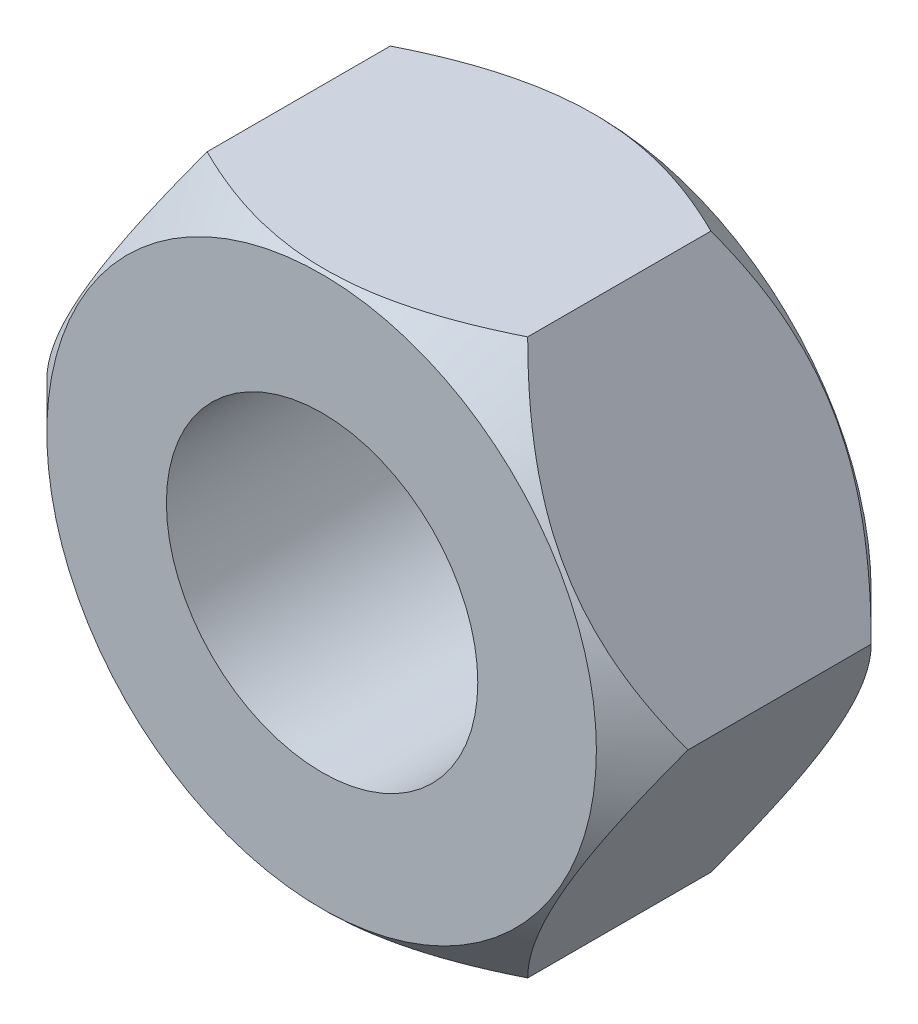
from build123d import *

# Parameters (mm, degrees)
ESQUISSE1_R             = 7
EXTRUSION1_DEPTH        = 6
TROU_TARAUD_M81_D       = 6.8
CHANFREIN1_SIZE         = 1
ESQUISSE4_OUTSIDE_W     = 20.138
ESQUISSE4_OUTSIDE_H     = 20.138
ENL_V_MAT_EXTRU_1_DEPTH = 10


with BuildPart() as part:
    # Esquisse1 → Extrusion1 (new body)
    with BuildSketch(Plane.XY):
        Circle(ESQUISSE1_R)
    extrude(amount=EXTRUSION1_DEPTH)

    # Trou taraud_ M81 (through all)
    with Locations(Plane.XY.offset(6)):
        with Locations((0.010473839, -0.020947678)):
            Hole(TROU_TARAUD_M81_D / 2)

    # Chanfrein1
    chanfrein1_edges = [part.edges().sort_by_distance(p)[0] for p in [
        (-7, 0, 0),
        (-7, 0, 6),
    ]]
    chamfer(chanfrein1_edges, length=CHANFREIN1_SIZE)

    # Esquisse4 outside → Enl_v. mat.-Extru.1 (cut)
    with BuildSketch(Plane.XY.offset(6)):
        Rectangle(ESQUISSE4_OUTSIDE_W, ESQUISSE4_OUTSIDE_H)
        Polygon((7, 0), (3.5, 6.062177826), (-3.5, 6.062177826), (-7, 0), (-3.5, -6.062177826), (3.5, -6.062177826), align=None, mode=Mode.SUBTRACT)
    extrude(amount=-ENL_V_MAT_EXTRU_1_DEPTH, mode=Mode.SUBTRACT)


solid = part.part
